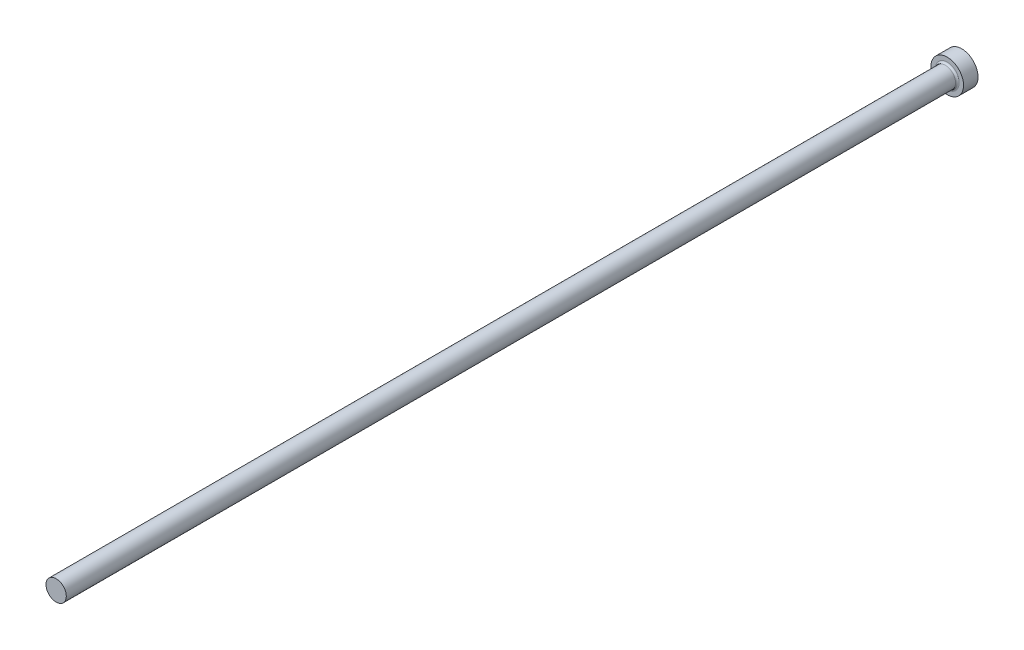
from build123d import *

# Parameters (mm, degrees)
FILLET1_R = 0.5


with BuildPart() as part:
    # FV → Revolve1 (revolve)
    with BuildSketch(Plane(origin=(0, 0, 0), x_dir=(1, 0, 0), z_dir=(0, 1, 0)), mode=Mode.PRIVATE) as revolve1_sk:
        Polygon((0, 0), (4.5, 0), (4.5, -4), (2.8, -4), (2.8, -250), (0, -250), align=None)
    revolve(revolve1_sk.sketch.rotate(Axis((0, 0, -9.033228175), (0, 0, 1)), 180), axis=Axis((0, 0, -9.033228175), (0, 0, 1)))

    # Fillet1
    fillet1_edges = [part.edges().sort_by_distance(p)[0] for p in [
        (2.8, 0, 4),
    ]]
    fillet(fillet1_edges, radius=FILLET1_R)


solid = part.part
